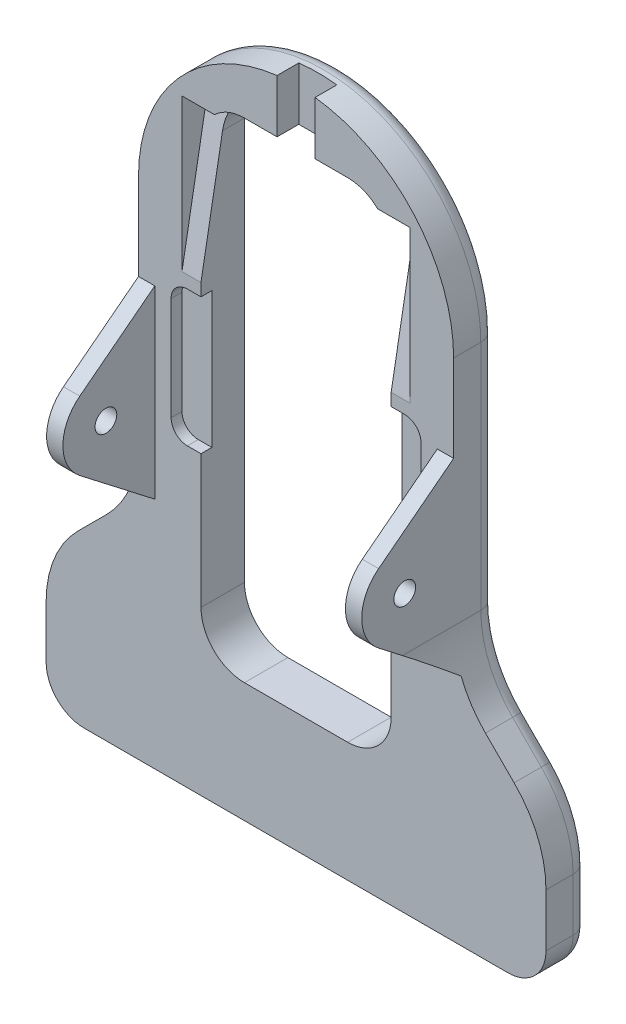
from build123d import *

# Parameters (mm, degrees)
EXTRUDE_1_DEPTH     = 8
EXTRUDE_2_DEPTH     = 29
SKETCH_3_W          = 52
SKETCH_3_H          = 22
CUT_EXTRUDE_1_DEPTH = 134.790881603
CUT_EXTRUDE_2_REACH = 148.318
SKETCH_4_R          = 2
CUT_EXTRUDE_3_DEPTH = 133.227077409
CUT_EXTRUDE_4_DEPTH = 2
FILLET_1_R          = 20
FILLET_2_R          = 7
FILLET_3_R          = 8
SKETCH_7_W          = 7
SKETCH_7_H          = 10
CUT_EXTRUDE_5_DEPTH = 4
FILLET_4_R          = 3
CUT_EXTRUDE_6_DEPTH = 21


with BuildPart() as part:
    # Sketch 1 → Extrude 1 (new body)
    with BuildSketch(Plane.XY):
        with BuildLine():
            Line((46, 0), (-46, 0))
            Line((-46, 0), (-46, 25))
            Line((-46, 25), (-29, 42))
            Line((-29, 42), (-29, 93))
            ThreePointArc((-29, 93), (0, 122), (29, 93))
            Line((29, 93), (29, 42))
            Line((29, 42), (46, 25))
            Line((46, 25), (46, 0))
        make_face()
    extrude(amount=EXTRUDE_1_DEPTH)

    # Sketch 2 → Extrude 2 (add, symmetric)
    with BuildSketch(Plane(origin=(0, 0, 0), x_dir=(0, 0, -1), z_dir=(1, 0, 0))):
        Polygon((-30, 60), (-8, 77), (-8, 43), align=None)
    extrude(amount=EXTRUDE_2_DEPTH, both=True)

    # Sketch 3 → Cut-Extrude 1 (cut, through all)
    with BuildSketch(Plane.XZ):
        with Locations((0, 19)):
            Rectangle(SKETCH_3_W, SKETCH_3_H)
    extrude(amount=-CUT_EXTRUDE_1_DEPTH, mode=Mode.SUBTRACT)

    # Cut-Extrude 2: up to this face of the body (flat: up to its plane)
    cut_extrude_2_end = Plane(part.part.faces().sort_by_distance((-46, 12.5, 4))[0])
    # Sketch 4 → Cut-Extrude 2 (cut, up to the picked face)
    with BuildSketch(Plane(origin=(29, 0, 0), x_dir=(0, 0, -1), z_dir=(1, 0, 0)), mode=Mode.PRIVATE) as cut_extrude_2_sk1:
        with Locations((-17, 60)):
            Circle(SKETCH_4_R)
    cut_extrude_2_tool1 = split(extrude(cut_extrude_2_sk1.sketch, amount=-CUT_EXTRUDE_2_REACH, mode=Mode.PRIVATE), bisect_by=cut_extrude_2_end, keep=Keep.BOTH, mode=Mode.PRIVATE)
    add(cut_extrude_2_tool1.solids().sort_by(Axis((29, 60, 17), (-1, 0, 0)))[0], mode=Mode.SUBTRACT)

    # Sketch 5 → Cut-Extrude 3 (cut, through all)
    with BuildSketch(Plane.XY.offset(8)):
        with BuildLine():
            Line((-9.5, 112), (9.5, 112))
            ThreePointArc((9.5, 112), (15.156854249, 109.656854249), (17.5, 104))
            Line((17.5, 104), (17.5, 30))
            ThreePointArc((17.5, 30), (15.156854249, 24.343145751), (9.5, 22))
            Line((9.5, 22), (-9.5, 22))
            ThreePointArc((-9.5, 22), (-15.156854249, 24.343145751), (-17.5, 30))
            Line((-17.5, 30), (-17.5, 104))
            ThreePointArc((-17.5, 104), (-15.156854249, 109.656854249), (-9.5, 112))
        make_face()
    extrude(amount=-CUT_EXTRUDE_3_DEPTH, mode=Mode.SUBTRACT)

    # Sketch 6 → Cut-Extrude 4 (cut)
    with BuildSketch(Plane.XY.offset(8)):
        with BuildLine():
            Line((-20, 79.5), (20, 79.5))
            ThreePointArc((20, 79.5), (22.121320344, 78.621320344), (23, 76.5))
            Line((23, 76.5), (23, 57.5))
            ThreePointArc((23, 57.5), (22.121320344, 55.378679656), (20, 54.5))
            Line((20, 54.5), (-20, 54.5))
            ThreePointArc((-20, 54.5), (-22.121320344, 55.378679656), (-23, 57.5))
            Line((-23, 57.5), (-23, 76.5))
            ThreePointArc((-23, 76.5), (-22.121320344, 78.621320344), (-20, 79.5))
        make_face()
    extrude(amount=-CUT_EXTRUDE_4_DEPTH, mode=Mode.SUBTRACT)

    # Fillet 1
    fillet_1_edges = [part.edges().sort_by_distance(p)[0] for p in [
        (46, 25, 4),
        (-46, 25, 4),
        (-29, 42, 4),
        (29, 42, 4),
    ]]
    fillet(fillet_1_edges, radius=FILLET_1_R)

    # Fillet 2
    fillet_2_edges = [part.edges().sort_by_distance(p)[0] for p in [
        (46, 0, 4),
        (-46, 0, 4),
    ]]
    fillet(fillet_2_edges, radius=FILLET_2_R)

    # Fillet 3
    fillet_3_edges = [part.edges().sort_by_distance(p)[0] for p in [
        (27.5, 60, 30),
        (-27.5, 60, 30),
    ]]
    fillet(fillet_3_edges, radius=FILLET_3_R)

    # Sketch 7 → Cut-Extrude 5 (cut)
    with BuildSketch(Plane.XY.offset(8)):
        with Locations((0, 117)):
            Rectangle(SKETCH_7_W, SKETCH_7_H)
    extrude(amount=-CUT_EXTRUDE_5_DEPTH, mode=Mode.SUBTRACT)

    # Fillet 4
    fillet_4_edges = [part.edges().sort_by_distance(p)[0] for p in [
        (37.5, 33.5, 0),
        (-46, 11.857864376, 0),
        (-37.5, 33.5, 0),
        (29, 71.642135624, 0),
        (-44.47759065, 24.3693974, 0),
        (44.47759065, 24.3693974, 0),
        (-30.52240935, 42.6306026, 0),
        (30.52240935, 42.6306026, 0),
        (0, 0, 0),
        (46, 11.857864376, 0),
        (43.949747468, 2.050252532, 0),
        (-43.949747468, 2.050252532, 0),
        (-29, 71.642135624, 0),
        (0, 122, 0),
    ]]
    fillet(fillet_4_edges, radius=FILLET_4_R)

    # Sketch 9 → Cut-Extrude 6 (cut, symmetric)
    with BuildSketch(Plane(origin=(0, 0, 0), x_dir=(0, 0, -1), z_dir=(1, 0, 0))):
        Polygon((-8, 81.788018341), (-8, 109.788018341), (-3, 109.788018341), align=None)
    extrude(amount=CUT_EXTRUDE_6_DEPTH, both=True, mode=Mode.SUBTRACT)


solid = part.part
